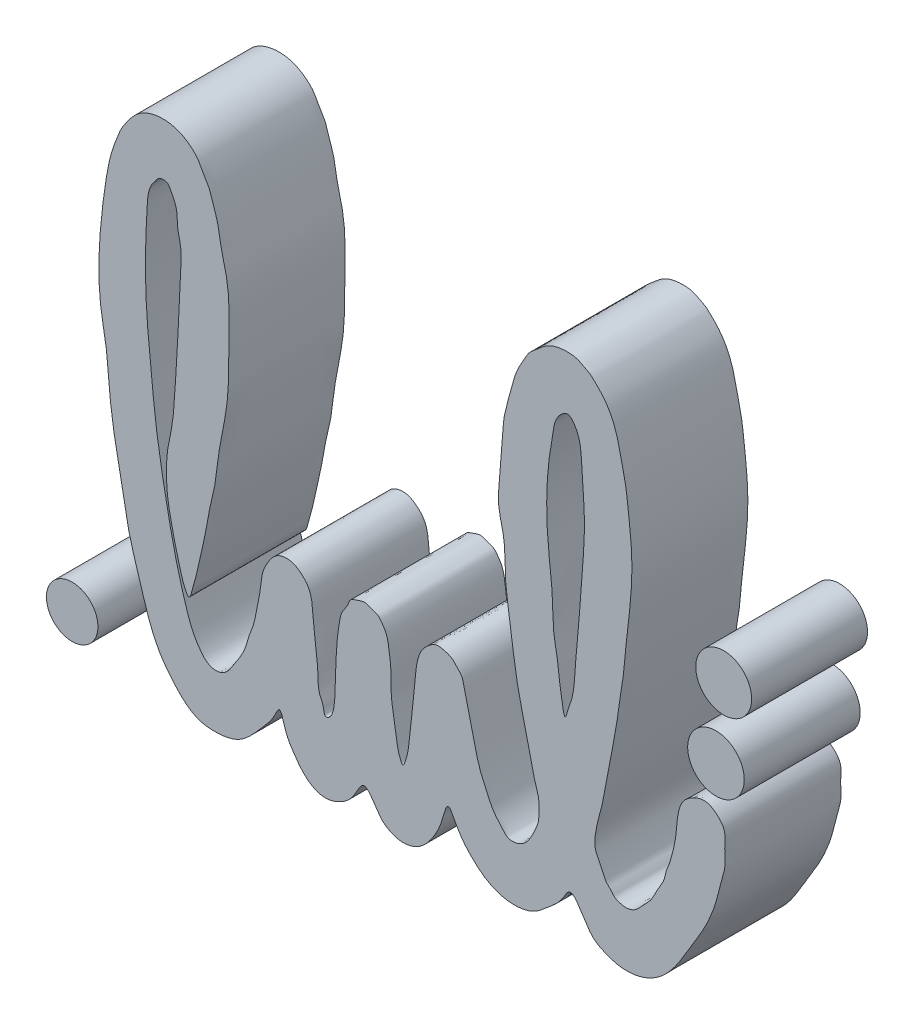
ISO-10303-21;
HEADER;
FILE_DESCRIPTION(('STEP AP214'),'2;1');
FILE_NAME('part.step','',(''),(''),'','','');
FILE_SCHEMA(('AUTOMOTIVE_DESIGN { 1 0 10303 214 1 1 1 1 }'));
ENDSEC;
DATA;
#1=APPLICATION_CONTEXT('core data for automotive mechanical design processes');
#2=APPLICATION_PROTOCOL_DEFINITION('international standard','automotive_design',2000,#1);
#3=PRODUCT_CONTEXT('',#1,'mechanical');
#4=PRODUCT('Part','Part','',(#3));
#5=PRODUCT_RELATED_PRODUCT_CATEGORY('part','',(#4));
#6=PRODUCT_DEFINITION_FORMATION('','',#4);
#7=PRODUCT_DEFINITION_CONTEXT('part definition',#1,'design');
#8=PRODUCT_DEFINITION('design','',#6,#7);
#9=PRODUCT_DEFINITION_SHAPE('','',#8);
#10=(LENGTH_UNIT() NAMED_UNIT(*) SI_UNIT(.MILLI.,.METRE.));
#11=(NAMED_UNIT(*) PLANE_ANGLE_UNIT() SI_UNIT($,.RADIAN.));
#12=(NAMED_UNIT(*) SI_UNIT($,.STERADIAN.) SOLID_ANGLE_UNIT());
#13=UNCERTAINTY_MEASURE_WITH_UNIT(LENGTH_MEASURE(1.E-05),#10,'distance_accuracy_value','');
#14=(GEOMETRIC_REPRESENTATION_CONTEXT(3) GLOBAL_UNCERTAINTY_ASSIGNED_CONTEXT((#13)) GLOBAL_UNIT_ASSIGNED_CONTEXT((#10,
#11,#12)) REPRESENTATION_CONTEXT('',''));
#15=CARTESIAN_POINT('',(0.,0.,0.));
#16=DIRECTION('',(0.,0.,1.));
#17=DIRECTION('',(1.,0.,0.));
#18=AXIS2_PLACEMENT_3D('',#15,#16,#17);
#19=CARTESIAN_POINT('',(10.0815790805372,1.43330764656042,3.6));
#20=DIRECTION('',(0.,0.,-1.));
#21=DIRECTION('',(-1.,0.,0.));
#22=AXIS2_PLACEMENT_3D('',#19,#20,#21);
#23=CYLINDRICAL_SURFACE('',#22,0.866436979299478);
#24=CARTESIAN_POINT('',(10.0815790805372,1.43330764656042,3.6));
#25=DIRECTION('',(0.,0.,1.));
#26=DIRECTION('',(1.,0.,0.));
#27=AXIS2_PLACEMENT_3D('',#24,#25,#26);
#28=CIRCLE('',#27,0.866436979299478);
#29=CARTESIAN_POINT('',(10.9480160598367,1.43330764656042,3.6));
#30=VERTEX_POINT('',#29);
#31=EDGE_CURVE('E11',#30,#30,#28,.T.);
#32=ORIENTED_EDGE('',*,*,#31,.F.);
#33=EDGE_LOOP('',(#32));
#34=FACE_BOUND('',#33,.T.);
#35=CARTESIAN_POINT('',(10.0815790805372,1.43330764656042,0.));
#36=DIRECTION('',(0.,0.,1.));
#37=DIRECTION('',(1.,0.,0.));
#38=AXIS2_PLACEMENT_3D('',#35,#36,#37);
#39=CIRCLE('',#38,0.866436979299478);
#40=CARTESIAN_POINT('',(10.9480160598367,1.43330764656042,0.));
#41=VERTEX_POINT('',#40);
#42=EDGE_CURVE('E42',#41,#41,#39,.T.);
#43=ORIENTED_EDGE('',*,*,#42,.T.);
#44=EDGE_LOOP('',(#43));
#45=FACE_BOUND('',#44,.T.);
#46=ADVANCED_FACE('F39',(#34,#45),#23,.T.);
#47=CARTESIAN_POINT('',(10.0815790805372,1.43330764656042,3.6));
#48=DIRECTION('',(0.,0.,1.));
#49=DIRECTION('',(1.,0.,0.));
#50=AXIS2_PLACEMENT_3D('',#47,#48,#49);
#51=PLANE('',#50);
#52=ORIENTED_EDGE('',*,*,#31,.T.);
#53=EDGE_LOOP('',(#52));
#54=FACE_BOUND('',#53,.T.);
#55=ADVANCED_FACE('F54',(#54),#51,.T.);
#56=CARTESIAN_POINT('',(10.0815790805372,1.43330764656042,0.));
#57=DIRECTION('',(0.,0.,1.));
#58=DIRECTION('',(1.,0.,0.));
#59=AXIS2_PLACEMENT_3D('',#56,#57,#58);
#60=PLANE('',#59);
#61=ORIENTED_EDGE('',*,*,#42,.F.);
#62=EDGE_LOOP('',(#61));
#63=FACE_BOUND('',#62,.T.);
#64=ADVANCED_FACE('F52',(#63),#60,.F.);
#65=CLOSED_SHELL('',(#46,#55,#64));
#66=MANIFOLD_SOLID_BREP('B2',#65);
#67=CARTESIAN_POINT('',(9.84206747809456,-0.855358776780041,3.6));
#68=DIRECTION('',(0.,0.,-1.));
#69=DIRECTION('',(-1.,0.,0.));
#70=AXIS2_PLACEMENT_3D('',#67,#68,#69);
#71=CYLINDRICAL_SURFACE('',#70,0.878209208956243);
#72=CARTESIAN_POINT('',(9.84206747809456,-0.855358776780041,3.6));
#73=DIRECTION('',(0.,0.,1.));
#74=DIRECTION('',(1.,0.,0.));
#75=AXIS2_PLACEMENT_3D('',#72,#73,#74);
#76=CIRCLE('',#75,0.878209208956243);
#77=CARTESIAN_POINT('',(10.7202766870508,-0.855358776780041,3.6));
#78=VERTEX_POINT('',#77);
#79=EDGE_CURVE('E38',#78,#78,#76,.T.);
#80=ORIENTED_EDGE('',*,*,#79,.F.);
#81=EDGE_LOOP('',(#80));
#82=FACE_BOUND('',#81,.T.);
#83=CARTESIAN_POINT('',(9.84206747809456,-0.855358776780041,0.));
#84=DIRECTION('',(0.,0.,1.));
#85=DIRECTION('',(1.,0.,0.));
#86=AXIS2_PLACEMENT_3D('',#83,#84,#85);
#87=CIRCLE('',#86,0.878209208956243);
#88=CARTESIAN_POINT('',(10.7202766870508,-0.855358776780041,0.));
#89=VERTEX_POINT('',#88);
#90=EDGE_CURVE('E90',#89,#89,#87,.T.);
#91=ORIENTED_EDGE('',*,*,#90,.T.);
#92=EDGE_LOOP('',(#91));
#93=FACE_BOUND('',#92,.T.);
#94=ADVANCED_FACE('F87',(#82,#93),#71,.T.);
#95=CARTESIAN_POINT('',(9.84206747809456,-0.855358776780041,3.6));
#96=DIRECTION('',(0.,0.,1.));
#97=DIRECTION('',(1.,0.,0.));
#98=AXIS2_PLACEMENT_3D('',#95,#96,#97);
#99=PLANE('',#98);
#100=ORIENTED_EDGE('',*,*,#79,.T.);
#101=EDGE_LOOP('',(#100));
#102=FACE_BOUND('',#101,.T.);
#103=ADVANCED_FACE('F102',(#102),#99,.T.);
#104=CARTESIAN_POINT('',(9.84206747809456,-0.855358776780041,0.));
#105=DIRECTION('',(0.,0.,1.));
#106=DIRECTION('',(1.,0.,0.));
#107=AXIS2_PLACEMENT_3D('',#104,#105,#106);
#108=PLANE('',#107);
#109=ORIENTED_EDGE('',*,*,#90,.F.);
#110=EDGE_LOOP('',(#109));
#111=FACE_BOUND('',#110,.T.);
#112=ADVANCED_FACE('F100',(#111),#108,.F.);
#113=CLOSED_SHELL('',(#94,#103,#112));
#114=MANIFOLD_SOLID_BREP('B6',#113);
#115=CARTESIAN_POINT('',(-10.1483436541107,-6.7735083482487,3.6));
#116=DIRECTION('',(0.,0.,-1.));
#117=DIRECTION('',(-1.,0.,0.));
#118=AXIS2_PLACEMENT_3D('',#115,#116,#117);
#119=CYLINDRICAL_SURFACE('',#118,0.799672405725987);
#120=CARTESIAN_POINT('',(-10.1483436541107,-6.7735083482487,3.6));
#121=DIRECTION('',(0.,0.,1.));
#122=DIRECTION('',(1.,0.,0.));
#123=AXIS2_PLACEMENT_3D('',#120,#121,#122);
#124=CIRCLE('',#123,0.799672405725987);
#125=CARTESIAN_POINT('',(-9.34867124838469,-6.7735083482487,3.6));
#126=VERTEX_POINT('',#125);
#127=EDGE_CURVE('E86',#126,#126,#124,.T.);
#128=ORIENTED_EDGE('',*,*,#127,.F.);
#129=EDGE_LOOP('',(#128));
#130=FACE_BOUND('',#129,.T.);
#131=CARTESIAN_POINT('',(-10.1483436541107,-6.7735083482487,0.));
#132=DIRECTION('',(0.,0.,1.));
#133=DIRECTION('',(1.,0.,0.));
#134=AXIS2_PLACEMENT_3D('',#131,#132,#133);
#135=CIRCLE('',#134,0.799672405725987);
#136=CARTESIAN_POINT('',(-9.34867124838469,-6.7735083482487,0.));
#137=VERTEX_POINT('',#136);
#138=EDGE_CURVE('E137',#137,#137,#135,.T.);
#139=ORIENTED_EDGE('',*,*,#138,.T.);
#140=EDGE_LOOP('',(#139));
#141=FACE_BOUND('',#140,.T.);
#142=ADVANCED_FACE('F134',(#130,#141),#119,.T.);
#143=CARTESIAN_POINT('',(-10.1483436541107,-6.7735083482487,3.6));
#144=DIRECTION('',(0.,0.,1.));
#145=DIRECTION('',(1.,0.,0.));
#146=AXIS2_PLACEMENT_3D('',#143,#144,#145);
#147=PLANE('',#146);
#148=ORIENTED_EDGE('',*,*,#127,.T.);
#149=EDGE_LOOP('',(#148));
#150=FACE_BOUND('',#149,.T.);
#151=ADVANCED_FACE('F149',(#150),#147,.T.);
#152=CARTESIAN_POINT('',(-10.1483436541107,-6.7735083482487,0.));
#153=DIRECTION('',(0.,0.,1.));
#154=DIRECTION('',(1.,0.,0.));
#155=AXIS2_PLACEMENT_3D('',#152,#153,#154);
#156=PLANE('',#155);
#157=ORIENTED_EDGE('',*,*,#138,.F.);
#158=EDGE_LOOP('',(#157));
#159=FACE_BOUND('',#158,.T.);
#160=ADVANCED_FACE('F147',(#159),#156,.F.);
#161=CLOSED_SHELL('',(#142,#151,#160));
#162=MANIFOLD_SOLID_BREP('B33',#161);
#163=CARTESIAN_POINT('',(-7.84357930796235,2.61084673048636,3.6));
#164=DIRECTION('',(0.,0.,-1.));
#165=DIRECTION('',(-1.,0.,0.));
#166=AXIS2_PLACEMENT_3D('',#163,#164,#165);
#167=PLANE('',#166);
#168=CARTESIAN_POINT('',(9.15796613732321,-2.12305920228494,3.6));
#169=CARTESIAN_POINT('',(9.02510179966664,-2.1872144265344,3.6));
#170=CARTESIAN_POINT('',(8.79222780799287,-2.34918255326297,3.6));
#171=CARTESIAN_POINT('',(8.61623881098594,-2.88996750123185,3.6));
#172=CARTESIAN_POINT('',(8.62215522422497,-3.44216824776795,3.6));
#173=CARTESIAN_POINT('',(8.48974806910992,-3.93563104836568,3.6));
#174=CARTESIAN_POINT('',(8.41029318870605,-4.26715294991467,3.6));
#175=CARTESIAN_POINT('',(8.28483133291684,-4.50344427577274,3.6));
#176=CARTESIAN_POINT('',(8.24558091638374,-4.81508898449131,3.6));
#177=CARTESIAN_POINT('',(8.0196976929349,-5.13441673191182,3.6));
#178=CARTESIAN_POINT('',(7.86771152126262,-5.51152221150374,3.6));
#179=CARTESIAN_POINT('',(7.62256017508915,-5.75342682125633,3.6));
#180=CARTESIAN_POINT('',(7.48158854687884,-5.90877588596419,3.6));
#181=CARTESIAN_POINT('',(7.3564442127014,-6.03578294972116,3.6));
#182=CARTESIAN_POINT('',(7.20066678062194,-6.11562868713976,3.6));
#183=CARTESIAN_POINT('',(7.01307048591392,-6.14160886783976,3.6));
#184=CARTESIAN_POINT('',(6.83519033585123,-6.09477772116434,3.6));
#185=CARTESIAN_POINT('',(6.68722582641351,-6.03788662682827,3.6));
#186=CARTESIAN_POINT('',(6.61052689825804,-5.92063582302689,3.6));
#187=CARTESIAN_POINT('',(6.52059639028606,-5.8415627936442,3.6));
#188=CARTESIAN_POINT('',(6.4194672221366,-5.73544277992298,3.6));
#189=CARTESIAN_POINT('',(6.32696243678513,-5.52206572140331,3.6));
#190=CARTESIAN_POINT('',(6.19652563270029,-5.28138815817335,3.6));
#191=CARTESIAN_POINT('',(6.04887942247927,-4.94313643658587,3.6));
#192=CARTESIAN_POINT('',(6.1041471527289,-4.58695114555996,3.6));
#193=CARTESIAN_POINT('',(6.16988785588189,-4.22227215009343,3.6));
#194=CARTESIAN_POINT('',(6.28697980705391,-3.86468136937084,3.6));
#195=CARTESIAN_POINT('',(6.35564876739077,-3.46790228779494,3.6));
#196=CARTESIAN_POINT('',(6.43391023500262,-3.04582680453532,3.6));
#197=CARTESIAN_POINT('',(6.52160115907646,-2.62887019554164,3.6));
#198=CARTESIAN_POINT('',(6.6124439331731,-2.17744645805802,3.6));
#199=CARTESIAN_POINT('',(6.67792439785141,-1.6948809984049,3.6));
#200=CARTESIAN_POINT('',(6.79361000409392,-1.16932879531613,3.6));
#201=CARTESIAN_POINT('',(6.84601434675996,-0.599677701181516,3.6));
#202=CARTESIAN_POINT('',(6.97051518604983,0.00688747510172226,3.6));
#203=CARTESIAN_POINT('',(7.02396668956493,0.753118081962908,3.6));
#204=CARTESIAN_POINT('',(7.15840122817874,1.84126684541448,3.6));
#205=CARTESIAN_POINT('',(7.28976850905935,3.18850129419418,3.6));
#206=CARTESIAN_POINT('',(7.13607919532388,4.41329132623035,3.6));
#207=CARTESIAN_POINT('',(7.04585057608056,5.23134594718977,3.6));
#208=CARTESIAN_POINT('',(6.93651110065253,5.68898695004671,3.6));
#209=CARTESIAN_POINT('',(6.85485691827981,6.05995383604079,3.6));
#210=CARTESIAN_POINT('',(6.75741310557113,6.49344597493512,3.6));
#211=CARTESIAN_POINT('',(6.59161460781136,6.90450767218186,3.6));
#212=CARTESIAN_POINT('',(6.32087086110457,7.29386205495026,3.6));
#213=CARTESIAN_POINT('',(6.10915865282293,7.50296630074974,3.6));
#214=CARTESIAN_POINT('',(5.91799232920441,7.68178143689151,3.6));
#215=CARTESIAN_POINT('',(5.75853676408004,7.75079845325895,3.6));
#216=CARTESIAN_POINT('',(5.53101287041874,7.88883804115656,3.6));
#217=CARTESIAN_POINT('',(5.17788675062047,7.92359045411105,3.6));
#218=CARTESIAN_POINT('',(4.83822612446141,7.87200544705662,3.6));
#219=CARTESIAN_POINT('',(4.51212961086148,7.71858688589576,3.6));
#220=CARTESIAN_POINT('',(4.29887179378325,7.51385503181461,3.6));
#221=CARTESIAN_POINT('',(3.98776118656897,7.26961650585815,3.6));
#222=CARTESIAN_POINT('',(3.86717551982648,6.98016724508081,3.6));
#223=CARTESIAN_POINT('',(3.67064423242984,6.66111547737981,3.6));
#224=CARTESIAN_POINT('',(3.53454703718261,6.26502698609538,3.6));
#225=CARTESIAN_POINT('',(3.40022155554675,5.72314191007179,3.6));
#226=CARTESIAN_POINT('',(3.24800594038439,5.19065902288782,3.6));
#227=CARTESIAN_POINT('',(3.21703461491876,4.65716234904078,3.6));
#228=CARTESIAN_POINT('',(3.16725975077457,4.14870972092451,3.6));
#229=CARTESIAN_POINT('',(3.13103409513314,3.47935379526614,3.6));
#230=CARTESIAN_POINT('',(3.03199582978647,2.72982482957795,3.6));
#231=CARTESIAN_POINT('',(3.32177926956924,1.83672671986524,3.6));
#232=CARTESIAN_POINT('',(3.26998048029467,0.953934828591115,3.6));
#233=CARTESIAN_POINT('',(3.38745462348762,0.150361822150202,3.6));
#234=CARTESIAN_POINT('',(3.48028931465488,-0.501578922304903,3.6));
#235=CARTESIAN_POINT('',(3.57449969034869,-1.20292245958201,3.6));
#236=CARTESIAN_POINT('',(3.70202946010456,-1.98915243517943,3.6));
#237=CARTESIAN_POINT('',(3.90540972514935,-2.79353436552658,3.6));
#238=CARTESIAN_POINT('',(4.08393187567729,-3.53523899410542,3.6));
#239=CARTESIAN_POINT('',(4.1933455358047,-4.10356769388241,3.6));
#240=CARTESIAN_POINT('',(4.35726888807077,-4.54636252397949,3.6));
#241=CARTESIAN_POINT('',(4.33982650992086,-4.86102597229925,3.6));
#242=CARTESIAN_POINT('',(4.34699334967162,-5.17309005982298,3.6));
#243=CARTESIAN_POINT('',(4.22693018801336,-5.45555217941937,3.6));
#244=CARTESIAN_POINT('',(4.08787131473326,-5.75789734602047,3.6));
#245=CARTESIAN_POINT('',(3.87014590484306,-6.02411966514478,3.6));
#246=CARTESIAN_POINT('',(3.60911902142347,-6.11490435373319,3.6));
#247=CARTESIAN_POINT('',(3.36248960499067,-6.10807382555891,3.6));
#248=CARTESIAN_POINT('',(3.21183944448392,-5.91896576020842,3.6));
#249=CARTESIAN_POINT('',(3.03772755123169,-5.73728441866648,3.6));
#250=CARTESIAN_POINT('',(2.86073635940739,-5.48713796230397,3.6));
#251=CARTESIAN_POINT('',(2.71370967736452,-5.14140958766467,3.6));
#252=CARTESIAN_POINT('',(2.50479410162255,-4.70921150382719,3.6));
#253=CARTESIAN_POINT('',(2.35354256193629,-4.13239512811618,3.6));
#254=CARTESIAN_POINT('',(2.20341265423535,-3.46651252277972,3.6));
#255=CARTESIAN_POINT('',(2.07361000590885,-2.91195959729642,3.6));
#256=CARTESIAN_POINT('',(1.99175355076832,-2.48128630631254,3.6));
#257=CARTESIAN_POINT('',(1.80388025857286,-2.29107202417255,3.6));
#258=CARTESIAN_POINT('',(1.64113766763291,-2.10498906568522,3.6));
#259=CARTESIAN_POINT('',(1.40508124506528,-2.03268987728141,3.6));
#260=CARTESIAN_POINT('',(1.15440142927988,-1.97541083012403,3.6));
#261=CARTESIAN_POINT('',(0.910601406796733,-2.1439384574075,3.6));
#262=CARTESIAN_POINT('',(0.708818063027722,-2.34311080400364,3.6));
#263=CARTESIAN_POINT('',(0.568143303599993,-2.67845113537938,3.6));
#264=CARTESIAN_POINT('',(0.495691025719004,-3.21818597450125,3.6));
#265=CARTESIAN_POINT('',(0.44511361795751,-3.89651307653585,3.6));
#266=CARTESIAN_POINT('',(0.354226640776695,-4.63207920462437,3.6));
#267=CARTESIAN_POINT('',(0.305430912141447,-5.2131521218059,3.6));
#268=CARTESIAN_POINT('',(0.22923825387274,-5.52872149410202,3.6));
#269=CARTESIAN_POINT('',(0.120846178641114,-5.84477562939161,3.6));
#270=CARTESIAN_POINT('',(-0.0317597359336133,-5.46924497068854,3.6));
#271=CARTESIAN_POINT('',(-0.0729104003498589,-5.16957587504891,3.6));
#272=CARTESIAN_POINT('',(-0.15506219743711,-4.60042320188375,3.6));
#273=CARTESIAN_POINT('',(-0.26451691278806,-4.07791753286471,3.6));
#274=CARTESIAN_POINT('',(-0.22532221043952,-3.47832966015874,3.6));
#275=CARTESIAN_POINT('',(-0.296852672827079,-2.97820266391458,3.6));
#276=CARTESIAN_POINT('',(-0.359836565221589,-2.50437826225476,3.6));
#277=CARTESIAN_POINT('',(-0.525460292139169,-2.26281118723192,3.6));
#278=CARTESIAN_POINT('',(-0.663475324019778,-2.09502469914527,3.6));
#279=CARTESIAN_POINT('',(-0.850742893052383,-2.05536641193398,3.6));
#280=CARTESIAN_POINT('',(-1.07451048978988,-1.9331921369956,3.6));
#281=CARTESIAN_POINT('',(-1.29462651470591,-2.04696584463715,3.6));
#282=CARTESIAN_POINT('',(-1.53280657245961,-2.10485357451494,3.6));
#283=CARTESIAN_POINT('',(-1.5881303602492,-2.35772833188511,3.6));
#284=CARTESIAN_POINT('',(-1.78712460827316,-2.563162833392,3.6));
#285=CARTESIAN_POINT('',(-1.86776422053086,-2.98170829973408,3.6));
#286=CARTESIAN_POINT('',(-1.97743516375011,-3.80027854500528,3.6));
#287=CARTESIAN_POINT('',(-1.95675978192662,-4.66709517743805,3.6));
#288=CARTESIAN_POINT('',(-2.02529862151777,-5.3994610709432,3.6));
#289=CARTESIAN_POINT('',(-2.13841019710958,-5.61323965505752,3.6));
#290=CARTESIAN_POINT('',(-2.32798941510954,-5.69313910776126,3.6));
#291=CARTESIAN_POINT('',(-2.33471701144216,-5.38173885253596,3.6));
#292=CARTESIAN_POINT('',(-2.53691551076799,-5.07390439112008,3.6));
#293=CARTESIAN_POINT('',(-2.49696841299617,-4.51744445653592,3.6));
#294=CARTESIAN_POINT('',(-2.61375636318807,-3.81945100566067,3.6));
#295=CARTESIAN_POINT('',(-2.664988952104,-3.16480241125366,3.6));
#296=CARTESIAN_POINT('',(-2.7157006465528,-2.61782607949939,3.6));
#297=CARTESIAN_POINT('',(-2.8687491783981,-2.34743329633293,3.6));
#298=CARTESIAN_POINT('',(-3.03573036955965,-2.18249910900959,3.6));
#299=CARTESIAN_POINT('',(-3.29406199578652,-1.99084478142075,3.6));
#300=CARTESIAN_POINT('',(-3.68151153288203,-1.98852146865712,3.6));
#301=CARTESIAN_POINT('',(-3.96398482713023,-2.21165350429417,3.6));
#302=CARTESIAN_POINT('',(-4.08977133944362,-2.44074409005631,3.6));
#303=CARTESIAN_POINT('',(-4.25463297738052,-2.73553061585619,3.6));
#304=CARTESIAN_POINT('',(-4.28047820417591,-3.12923956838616,3.6));
#305=CARTESIAN_POINT('',(-4.36368754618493,-3.58239479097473,3.6));
#306=CARTESIAN_POINT('',(-4.44422988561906,-3.97665571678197,3.6));
#307=CARTESIAN_POINT('',(-4.50871914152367,-4.31688205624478,3.6));
#308=CARTESIAN_POINT('',(-4.6347406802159,-4.57895059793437,3.6));
#309=CARTESIAN_POINT('',(-4.69967491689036,-4.83926211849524,3.6));
#310=CARTESIAN_POINT('',(-4.79566038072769,-5.12472113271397,3.6));
#311=CARTESIAN_POINT('',(-4.9375859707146,-5.40796964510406,3.6));
#312=CARTESIAN_POINT('',(-5.13537650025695,-5.66712987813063,3.6));
#313=CARTESIAN_POINT('',(-5.27678285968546,-5.94273713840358,3.6));
#314=CARTESIAN_POINT('',(-5.52947046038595,-6.12816018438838,3.6));
#315=CARTESIAN_POINT('',(-5.84208793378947,-6.12373370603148,3.6));
#316=CARTESIAN_POINT('',(-6.04164767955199,-5.98042458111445,3.6));
#317=CARTESIAN_POINT('',(-6.22851489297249,-5.73842179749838,3.6));
#318=CARTESIAN_POINT('',(-6.42144962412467,-5.4305057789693,3.6));
#319=CARTESIAN_POINT('',(-6.5929691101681,-4.93712736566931,3.6));
#320=CARTESIAN_POINT('',(-6.71807787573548,-4.51740242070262,3.6));
#321=CARTESIAN_POINT('',(-6.89947657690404,-3.8798923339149,3.6));
#322=CARTESIAN_POINT('',(-7.06562617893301,-3.15117212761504,3.6));
#323=CARTESIAN_POINT('',(-7.3338656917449,-1.81182097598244,3.6));
#324=CARTESIAN_POINT('',(-7.5432586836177,-0.587142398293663,3.6));
#325=CARTESIAN_POINT('',(-7.7176077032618,1.12552490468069,3.6));
#326=CARTESIAN_POINT('',(-7.91163483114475,2.93590512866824,3.6));
#327=CARTESIAN_POINT('',(-7.86577212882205,4.64118310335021,3.6));
#328=CARTESIAN_POINT('',(-7.79929108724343,5.66963607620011,3.6));
#329=CARTESIAN_POINT('',(-7.69432271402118,5.94356706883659,3.6));
#330=CARTESIAN_POINT('',(-7.56561572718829,6.1020195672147,3.6));
#331=CARTESIAN_POINT('',(-7.45474461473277,6.27497467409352,3.6));
#332=CARTESIAN_POINT('',(-7.16955574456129,6.28022773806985,3.6));
#333=CARTESIAN_POINT('',(-7.05442535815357,6.01339878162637,3.6));
#334=CARTESIAN_POINT('',(-6.85645134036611,5.66542953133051,3.6));
#335=CARTESIAN_POINT('',(-6.90490825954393,5.22616444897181,3.6));
#336=CARTESIAN_POINT('',(-6.72500762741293,4.61307083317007,3.6));
#337=CARTESIAN_POINT('',(-6.81056941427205,3.7937116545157,3.6));
#338=CARTESIAN_POINT('',(-6.8406931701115,2.63037788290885,3.6));
#339=CARTESIAN_POINT('',(-6.9139805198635,1.51050926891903,3.6));
#340=CARTESIAN_POINT('',(-6.9680727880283,0.501856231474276,3.6));
#341=CARTESIAN_POINT('',(-7.03398758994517,-0.237668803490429,3.6));
#342=CARTESIAN_POINT('',(-7.2189313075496,-0.970858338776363,3.6));
#343=CARTESIAN_POINT('',(-7.23370492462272,-1.68569486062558,3.6));
#344=CARTESIAN_POINT('',(-7.18059632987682,-2.34309788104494,3.6));
#345=CARTESIAN_POINT('',(-7.06370491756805,-2.82563339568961,3.6));
#346=CARTESIAN_POINT('',(-6.99185103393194,-3.19954310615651,3.6));
#347=CARTESIAN_POINT('',(-6.90013641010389,-3.55740754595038,3.6));
#348=CARTESIAN_POINT('',(-6.80919314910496,-3.88450619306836,3.6));
#349=CARTESIAN_POINT('',(-6.73265362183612,-4.18468087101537,3.6));
#350=CARTESIAN_POINT('',(-6.51013634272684,-4.7651728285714,3.6));
#351=CARTESIAN_POINT('',(-6.401842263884,-4.19291991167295,3.6));
#352=CARTESIAN_POINT('',(-6.29759447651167,-3.90912253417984,3.6));
#353=CARTESIAN_POINT('',(-6.20536528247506,-3.39841287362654,3.6));
#354=CARTESIAN_POINT('',(-6.02825713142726,-2.7780199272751,3.6));
#355=CARTESIAN_POINT('',(-5.9180311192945,-1.94042302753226,3.6));
#356=CARTESIAN_POINT('',(-5.70336446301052,-1.20459128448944,3.6));
#357=CARTESIAN_POINT('',(-5.63474375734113,-0.376273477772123,3.6));
#358=CARTESIAN_POINT('',(-5.47793466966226,0.413095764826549,3.6));
#359=CARTESIAN_POINT('',(-5.294931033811,1.38803732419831,3.6));
#360=CARTESIAN_POINT('',(-5.2912080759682,2.40957564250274,3.6));
#361=CARTESIAN_POINT('',(-5.26336883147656,3.54497859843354,3.6));
#362=CARTESIAN_POINT('',(-5.29493102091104,4.50825156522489,3.6));
#363=CARTESIAN_POINT('',(-5.54369437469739,5.32309788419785,3.6));
#364=CARTESIAN_POINT('',(-5.59747601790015,5.94422478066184,3.6));
#365=CARTESIAN_POINT('',(-5.79919038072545,6.42241213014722,3.6));
#366=CARTESIAN_POINT('',(-5.87391588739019,6.72945850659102,3.6));
#367=CARTESIAN_POINT('',(-6.05100854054,6.9790184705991,3.6));
#368=CARTESIAN_POINT('',(-6.17977187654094,7.30041869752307,3.6));
#369=CARTESIAN_POINT('',(-6.50002968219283,7.63444397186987,3.6));
#370=CARTESIAN_POINT('',(-6.99753082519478,7.91579963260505,3.6));
#371=CARTESIAN_POINT('',(-7.60443928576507,7.91202656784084,3.6));
#372=CARTESIAN_POINT('',(-8.09563555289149,7.68000699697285,3.6));
#373=CARTESIAN_POINT('',(-8.38108519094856,7.36103174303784,3.6));
#374=CARTESIAN_POINT('',(-8.62402927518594,7.01225118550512,3.6));
#375=CARTESIAN_POINT('',(-8.78992955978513,6.59170717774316,3.6));
#376=CARTESIAN_POINT('',(-8.9373883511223,6.19194865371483,3.6));
#377=CARTESIAN_POINT('',(-9.08311784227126,5.5291198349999,3.6));
#378=CARTESIAN_POINT('',(-9.28998746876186,4.04999404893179,3.6));
#379=CARTESIAN_POINT('',(-9.40491242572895,2.37866032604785,3.6));
#380=CARTESIAN_POINT('',(-9.0759677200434,0.893755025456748,3.6));
#381=CARTESIAN_POINT('',(-9.01113854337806,-0.133539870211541,3.6));
#382=CARTESIAN_POINT('',(-8.87092145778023,-1.33924289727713,3.6));
#383=CARTESIAN_POINT('',(-8.57532101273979,-2.63348262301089,3.6));
#384=CARTESIAN_POINT('',(-8.40626740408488,-3.78108658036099,3.6));
#385=CARTESIAN_POINT('',(-7.98534669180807,-5.03110284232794,3.6));
#386=CARTESIAN_POINT('',(-7.67965121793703,-6.23484940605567,3.6));
#387=CARTESIAN_POINT('',(-6.94755296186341,-7.19052679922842,3.6));
#388=CARTESIAN_POINT('',(-6.36871759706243,-7.73700939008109,3.6));
#389=CARTESIAN_POINT('',(-5.63915709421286,-7.79810165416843,3.6));
#390=CARTESIAN_POINT('',(-5.01995828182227,-7.7126794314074,3.6));
#391=CARTESIAN_POINT('',(-4.54801892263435,-7.2926784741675,3.6));
#392=CARTESIAN_POINT('',(-4.18237019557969,-6.85002194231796,3.6));
#393=CARTESIAN_POINT('',(-3.91514143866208,-6.56681697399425,3.6));
#394=CARTESIAN_POINT('',(-3.68945494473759,-6.00176955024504,3.6));
#395=CARTESIAN_POINT('',(-3.52421500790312,-6.75220663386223,3.6));
#396=CARTESIAN_POINT('',(-3.27074247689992,-7.12457975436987,3.6));
#397=CARTESIAN_POINT('',(-2.90211973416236,-7.65483982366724,3.6));
#398=CARTESIAN_POINT('',(-2.32714179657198,-7.92359045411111,3.6));
#399=CARTESIAN_POINT('',(-1.7511724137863,-7.7135289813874,3.6));
#400=CARTESIAN_POINT('',(-1.3865224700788,-7.40142948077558,3.6));
#401=CARTESIAN_POINT('',(-1.09938284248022,-6.69007422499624,3.6));
#402=CARTESIAN_POINT('',(-0.733888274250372,-7.30363331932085,3.6));
#403=CARTESIAN_POINT('',(-0.453672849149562,-7.68515060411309,3.6));
#404=CARTESIAN_POINT('',(0.0785273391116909,-7.91376117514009,3.6));
#405=CARTESIAN_POINT('',(0.635287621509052,-7.74006600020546,3.6));
#406=CARTESIAN_POINT('',(0.977790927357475,-7.37464984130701,3.6));
#407=CARTESIAN_POINT('',(1.23338587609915,-6.94332783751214,3.6));
#408=CARTESIAN_POINT('',(1.3533865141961,-6.59631144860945,3.6));
#409=CARTESIAN_POINT('',(1.51204429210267,-6.00273117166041,3.6));
#410=CARTESIAN_POINT('',(1.83233899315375,-6.67643514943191,3.6));
#411=CARTESIAN_POINT('',(2.13134633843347,-7.06704143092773,3.6));
#412=CARTESIAN_POINT('',(2.74897297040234,-7.62937526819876,3.6));
#413=CARTESIAN_POINT('',(3.49355841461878,-7.85986772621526,3.6));
#414=CARTESIAN_POINT('',(4.18968173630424,-7.71389616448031,3.6));
#415=CARTESIAN_POINT('',(4.66095153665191,-7.29162250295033,3.6));
#416=CARTESIAN_POINT('',(5.0195747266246,-7.01590647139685,3.6));
#417=CARTESIAN_POINT('',(5.39547014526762,-6.25729336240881,3.6));
#418=CARTESIAN_POINT('',(5.79278274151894,-7.32957086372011,3.6));
#419=CARTESIAN_POINT('',(6.2446873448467,-7.60614108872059,3.6));
#420=CARTESIAN_POINT('',(6.51717306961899,-7.71629222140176,3.6));
#421=CARTESIAN_POINT('',(6.98950187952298,-7.86533912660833,3.6));
#422=CARTESIAN_POINT('',(7.72859507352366,-7.77393033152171,3.6));
#423=CARTESIAN_POINT('',(8.47707936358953,-7.16957311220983,3.6));
#424=CARTESIAN_POINT('',(8.96107925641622,-6.32022784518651,3.6));
#425=CARTESIAN_POINT('',(9.50048779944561,-5.48452456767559,3.6));
#426=CARTESIAN_POINT('',(9.84095123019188,-4.66897155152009,3.6));
#427=CARTESIAN_POINT('',(9.97699957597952,-4.00647493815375,3.6));
#428=CARTESIAN_POINT('',(10.152836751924,-3.50625809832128,3.6));
#429=CARTESIAN_POINT('',(10.0845254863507,-3.01523541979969,3.6));
#430=CARTESIAN_POINT('',(10.1777960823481,-2.52767315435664,3.6));
#431=CARTESIAN_POINT('',(9.86860816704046,-2.19600584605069,3.6));
#432=CARTESIAN_POINT('',(9.5400077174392,-1.98028213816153,3.6));
#433=CARTESIAN_POINT('',(9.27825593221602,-2.06497575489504,3.6));
#434=CARTESIAN_POINT('',(9.15796613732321,-2.12305920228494,3.6));
#435=B_SPLINE_CURVE_WITH_KNOTS('',3,(#168,#169,#170,#171,#172,#173,#174,#175,#176,#177,#178,
#179,#180,#181,#182,#183,#184,#185,#186,#187,#188,#189,#190,#191,#192,#193,#194,#195,#196,#197,
#198,#199,#200,#201,#202,#203,#204,#205,#206,#207,#208,#209,#210,#211,#212,#213,#214,#215,#216,
#217,#218,#219,#220,#221,#222,#223,#224,#225,#226,#227,#228,#229,#230,#231,#232,#233,#234,#235,
#236,#237,#238,#239,#240,#241,#242,#243,#244,#245,#246,#247,#248,#249,#250,#251,#252,#253,#254,
#255,#256,#257,#258,#259,#260,#261,#262,#263,#264,#265,#266,#267,#268,#269,#270,#271,#272,#273,
#274,#275,#276,#277,#278,#279,#280,#281,#282,#283,#284,#285,#286,#287,#288,#289,#290,#291,#292,
#293,#294,#295,#296,#297,#298,#299,#300,#301,#302,#303,#304,#305,#306,#307,#308,#309,#310,#311,
#312,#313,#314,#315,#316,#317,#318,#319,#320,#321,#322,#323,#324,#325,#326,#327,#328,#329,#330,
#331,#332,#333,#334,#335,#336,#337,#338,#339,#340,#341,#342,#343,#344,#345,#346,#347,#348,#349,
#350,#351,#352,#353,#354,#355,#356,#357,#358,#359,#360,#361,#362,#363,#364,#365,#366,#367,#368,
#369,#370,#371,#372,#373,#374,#375,#376,#377,#378,#379,#380,#381,#382,#383,#384,#385,#386,#387,
#388,#389,#390,#391,#392,#393,#394,#395,#396,#397,#398,#399,#400,#401,#402,#403,#404,#405,#406,
#407,#408,#409,#410,#411,#412,#413,#414,#415,#416,#417,#418,#419,#420,#421,#422,#423,#424,#425,
#426,#427,#428,#429,#430,#431,#432,#433,#434),.UNSPECIFIED.,.T.,.F.,(4,1,1,1,1,1,1,1,1,1,1,1,1,
1,1,1,1,1,1,1,1,1,1,1,1,1,1,1,1,1,1,1,1,1,1,1,1,1,1,1,1,1,1,1,1,1,1,1,1,1,1,1,1,1,1,1,1,1,1,1,1,
1,1,1,1,1,1,1,1,1,1,1,1,1,1,1,1,1,1,1,1,1,1,1,1,1,1,1,1,1,1,1,1,1,1,1,1,1,1,1,1,1,1,1,1,1,1,1,1,
1,1,1,1,1,1,1,1,1,1,1,1,1,1,1,1,1,1,1,1,1,1,1,1,1,1,1,1,1,1,1,1,1,1,1,1,1,1,1,1,1,1,1,1,1,1,1,1,
1,1,1,1,1,1,1,1,1,1,1,1,1,1,1,1,1,1,1,1,1,1,1,1,1,1,1,1,1,1,1,1,1,1,1,1,1,1,1,1,1,1,1,1,1,1,1,1,
1,1,1,1,1,1,1,1,1,1,1,1,1,1,1,1,1,1,1,1,1,1,1,1,1,1,1,1,1,1,1,1,1,1,1,1,1,1,1,1,1,1,1,1,1,1,1,1,
1,1,1,1,1,1,1,1,1,1,1,4),(0.,0.00296589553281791,0.00576754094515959,0.0114461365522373,
0.0145592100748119,0.0164529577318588,0.0185945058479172,0.0201088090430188,0.0229398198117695,
0.026628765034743,0.0285386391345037,0.0301011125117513,0.0310551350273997,0.0322613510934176,
0.0337146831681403,0.0349048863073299,0.0361317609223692,0.0368908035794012,0.037778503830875,
0.0386511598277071,0.0399407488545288,0.0426041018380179,0.0444645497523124,0.0475358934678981,
0.0498872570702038,0.0523092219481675,0.0554052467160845,0.0583394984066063,0.0613312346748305,
0.0643581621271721,0.0680127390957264,0.0715589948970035,0.0756514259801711,0.0800138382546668,
0.0845490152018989,0.0913476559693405,0.103081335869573,0.112823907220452,0.117203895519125,
0.120360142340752,0.122699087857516,0.125187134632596,0.129697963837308,0.131892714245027,
0.135106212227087,0.135945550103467,0.137358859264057,0.138715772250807,0.141505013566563,
0.144553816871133,0.145855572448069,0.149008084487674,0.150717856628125,0.154078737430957,
0.155376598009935,0.158604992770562,0.162787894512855,0.167150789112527,0.170173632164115,
0.173986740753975,0.177883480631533,0.18429935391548,0.189583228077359,0.197257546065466,
0.202651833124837,0.206628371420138,0.211097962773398,0.217522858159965,0.223348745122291,
0.228525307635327,0.23354865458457,0.235517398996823,0.238339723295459,0.240079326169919,
0.242013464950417,0.244666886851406,0.24714688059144,0.2489165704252,0.250359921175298,
0.251959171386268,0.253679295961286,0.25574114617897,0.258319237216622,0.261565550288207,
0.265805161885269,0.270805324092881,0.275874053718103,0.27793099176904,0.279734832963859,
0.281379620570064,0.283010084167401,0.284853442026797,0.28645862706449,0.288904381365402,
0.290789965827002,0.293952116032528,0.300320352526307,0.305005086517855,0.30980618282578,
0.311761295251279,0.31310735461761,0.314356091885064,0.317519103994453,0.320976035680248,
0.325851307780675,0.328859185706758,0.333471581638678,0.336532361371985,0.338662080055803,
0.339577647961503,0.340968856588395,0.342559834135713,0.344609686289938,0.345831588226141,
0.347357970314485,0.349441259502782,0.351762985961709,0.356022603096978,0.366953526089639,
0.369891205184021,0.371358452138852,0.371838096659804,0.373656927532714,0.375422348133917,
0.380368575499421,0.384246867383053,0.390538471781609,0.394174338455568,0.395562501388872,
0.396961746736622,0.399090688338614,0.402198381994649,0.404217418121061,0.406369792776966,
0.407658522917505,0.411272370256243,0.414429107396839,0.417389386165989,0.419730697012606,
0.421664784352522,0.423457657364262,0.425355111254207,0.427988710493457,0.43006672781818,
0.432188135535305,0.434468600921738,0.43620702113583,0.438405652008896,0.439344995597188,
0.442647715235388,0.445969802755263,0.450281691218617,0.451859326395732,0.459895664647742,
0.465975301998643,0.480567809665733,0.485969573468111,0.502153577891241,0.518756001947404,
0.521787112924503,0.523742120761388,0.524764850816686,0.526095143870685,0.527899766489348,
0.52935974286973,0.531749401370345,0.5363662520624,0.538062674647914,0.545131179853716,
0.553260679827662,0.562674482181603,0.568657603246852,0.574507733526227,0.578230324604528,
0.584498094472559,0.58941623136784,0.59204594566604,0.594925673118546,0.597389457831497,
0.599895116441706,0.601759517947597,0.604935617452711,0.607247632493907,0.609806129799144,
0.612347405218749,0.617761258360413,0.623534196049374,0.62999357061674,0.633807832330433,
0.640952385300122,0.646902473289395,0.654607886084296,0.662331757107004,0.67085031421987,
0.674625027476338,0.680185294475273,0.683784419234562,0.685501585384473,0.686739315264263,
0.690158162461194,0.692685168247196,0.696311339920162,0.701912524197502,0.704601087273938,
0.707520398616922,0.710774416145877,0.713496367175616,0.7169807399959,0.719722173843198,
0.727727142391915,0.748428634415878,0.754284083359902,0.759583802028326,0.770031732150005,
0.779746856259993,0.787481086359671,0.794308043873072,0.807525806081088,0.812868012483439,
0.8197100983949,0.823147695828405,0.827946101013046,0.832342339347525,0.836100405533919,
0.83966233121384,0.841751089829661,0.845021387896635,0.849113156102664,0.85345133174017,
0.85784674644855,0.861365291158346,0.865414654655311,0.86879818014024,0.87269190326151,
0.875248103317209,0.879725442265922,0.883435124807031,0.886784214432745,0.890146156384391,
0.893465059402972,0.896071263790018,0.89839728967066,0.904146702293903,0.908858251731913,
0.915033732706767,0.919962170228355,0.922981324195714,0.928065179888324,0.930052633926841,
0.937835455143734,0.940079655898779,0.941906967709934,0.9439085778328,0.950504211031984,
0.956401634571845,0.963502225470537,0.970901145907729,0.977332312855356,0.981871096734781,
0.985180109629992,0.98821377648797,0.992286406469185,0.994636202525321,0.99731480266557,1.),.UNSPECIFIED.);
#436=CARTESIAN_POINT('',(9.15796613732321,-2.12305920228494,3.6));
#437=VERTEX_POINT('',#436);
#438=EDGE_CURVE('E133',#437,#437,#435,.T.);
#439=ORIENTED_EDGE('',*,*,#438,.T.);
#440=EDGE_LOOP('',(#439));
#441=FACE_BOUND('',#440,.T.);
#442=CARTESIAN_POINT('',(5.25195258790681,-1.69096679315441,3.6));
#443=CARTESIAN_POINT('',(5.43395665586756,-1.22783572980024,3.6));
#444=CARTESIAN_POINT('',(5.43675140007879,-0.726258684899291,3.6));
#445=CARTESIAN_POINT('',(5.59238471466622,0.83008740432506,3.6));
#446=CARTESIAN_POINT('',(5.67404674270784,2.10481164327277,3.6));
#447=CARTESIAN_POINT('',(5.812099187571,3.56097959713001,3.6));
#448=CARTESIAN_POINT('',(5.66772918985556,4.93594189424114,3.6));
#449=CARTESIAN_POINT('',(5.64163503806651,5.84300877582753,3.6));
#450=CARTESIAN_POINT('',(5.24359504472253,6.32371585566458,3.6));
#451=CARTESIAN_POINT('',(4.81933262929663,5.95960087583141,3.6));
#452=CARTESIAN_POINT('',(4.78210557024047,5.44428719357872,3.6));
#453=CARTESIAN_POINT('',(4.64903074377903,4.75027446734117,3.6));
#454=CARTESIAN_POINT('',(4.56284889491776,3.7333693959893,3.6));
#455=CARTESIAN_POINT('',(4.60227434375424,2.45306490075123,3.6));
#456=CARTESIAN_POINT('',(4.78805876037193,1.17250509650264,3.6));
#457=CARTESIAN_POINT('',(4.77029241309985,0.176171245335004,3.6));
#458=CARTESIAN_POINT('',(4.92759240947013,-0.482030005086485,3.6));
#459=CARTESIAN_POINT('',(4.99003867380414,-1.17670780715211,3.6));
#460=CARTESIAN_POINT('',(5.01924666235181,-1.23167758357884,3.6));
#461=CARTESIAN_POINT('',(5.14369653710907,-2.1537083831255,3.6));
#462=CARTESIAN_POINT('',(5.22909013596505,-1.74884102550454,3.6));
#463=CARTESIAN_POINT('',(5.24989517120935,-1.69620213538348,3.6));
#464=CARTESIAN_POINT('',(5.25195258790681,-1.69096679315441,3.6));
#465=B_SPLINE_CURVE_WITH_KNOTS('',3,(#442,#443,#444,#445,#446,#447,#448,#449,#450,#451,#452,
#453,#454,#455,#456,#457,#458,#459,#460,#461,#462,#463,#464),.UNSPECIFIED.,.T.,.F.,(4,1,1,1,1,1,
1,1,1,1,1,1,1,1,1,1,1,1,1,1,4),(0.,0.0743789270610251,0.155616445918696,0.222267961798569,
0.322969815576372,0.415893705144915,0.47383398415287,0.490168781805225,0.510583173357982,
0.552191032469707,0.585467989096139,0.638853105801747,0.738105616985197,0.817476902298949,
0.876243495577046,0.914419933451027,0.949592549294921,0.976413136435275,0.991592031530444,
0.999159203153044,1.),.UNSPECIFIED.);
#466=CARTESIAN_POINT('',(5.25195258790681,-1.69096679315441,3.6));
#467=VERTEX_POINT('',#466);
#468=EDGE_CURVE('E187',#467,#467,#465,.T.);
#469=ORIENTED_EDGE('',*,*,#468,.F.);
#470=EDGE_LOOP('',(#469));
#471=FACE_BOUND('',#470,.T.);
#472=ADVANCED_FACE('F174',(#441,#471),#167,.F.);
#473=CARTESIAN_POINT('',(-7.84357930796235,2.61084673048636,0.));
#474=DIRECTION('',(0.,0.,-1.));
#475=DIRECTION('',(-1.,0.,0.));
#476=AXIS2_PLACEMENT_3D('',#473,#474,#475);
#477=PLANE('',#476);
#478=CARTESIAN_POINT('',(9.15796613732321,-2.12305920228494,0.));
#479=CARTESIAN_POINT('',(9.02510179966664,-2.1872144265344,0.));
#480=CARTESIAN_POINT('',(8.79222780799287,-2.34918255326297,0.));
#481=CARTESIAN_POINT('',(8.61623881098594,-2.88996750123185,0.));
#482=CARTESIAN_POINT('',(8.62215522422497,-3.44216824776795,0.));
#483=CARTESIAN_POINT('',(8.48974806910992,-3.93563104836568,0.));
#484=CARTESIAN_POINT('',(8.41029318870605,-4.26715294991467,0.));
#485=CARTESIAN_POINT('',(8.28483133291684,-4.50344427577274,0.));
#486=CARTESIAN_POINT('',(8.24558091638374,-4.81508898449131,0.));
#487=CARTESIAN_POINT('',(8.0196976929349,-5.13441673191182,0.));
#488=CARTESIAN_POINT('',(7.86771152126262,-5.51152221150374,0.));
#489=CARTESIAN_POINT('',(7.62256017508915,-5.75342682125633,0.));
#490=CARTESIAN_POINT('',(7.48158854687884,-5.90877588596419,0.));
#491=CARTESIAN_POINT('',(7.3564442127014,-6.03578294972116,0.));
#492=CARTESIAN_POINT('',(7.20066678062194,-6.11562868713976,0.));
#493=CARTESIAN_POINT('',(7.01307048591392,-6.14160886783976,0.));
#494=CARTESIAN_POINT('',(6.83519033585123,-6.09477772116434,0.));
#495=CARTESIAN_POINT('',(6.68722582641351,-6.03788662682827,0.));
#496=CARTESIAN_POINT('',(6.61052689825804,-5.92063582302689,0.));
#497=CARTESIAN_POINT('',(6.52059639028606,-5.8415627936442,0.));
#498=CARTESIAN_POINT('',(6.4194672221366,-5.73544277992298,0.));
#499=CARTESIAN_POINT('',(6.32696243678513,-5.52206572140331,0.));
#500=CARTESIAN_POINT('',(6.19652563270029,-5.28138815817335,0.));
#501=CARTESIAN_POINT('',(6.04887942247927,-4.94313643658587,0.));
#502=CARTESIAN_POINT('',(6.1041471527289,-4.58695114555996,0.));
#503=CARTESIAN_POINT('',(6.16988785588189,-4.22227215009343,0.));
#504=CARTESIAN_POINT('',(6.28697980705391,-3.86468136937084,0.));
#505=CARTESIAN_POINT('',(6.35564876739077,-3.46790228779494,0.));
#506=CARTESIAN_POINT('',(6.43391023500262,-3.04582680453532,0.));
#507=CARTESIAN_POINT('',(6.52160115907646,-2.62887019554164,0.));
#508=CARTESIAN_POINT('',(6.6124439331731,-2.17744645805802,0.));
#509=CARTESIAN_POINT('',(6.67792439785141,-1.6948809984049,0.));
#510=CARTESIAN_POINT('',(6.79361000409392,-1.16932879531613,0.));
#511=CARTESIAN_POINT('',(6.84601434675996,-0.599677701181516,0.));
#512=CARTESIAN_POINT('',(6.97051518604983,0.00688747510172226,0.));
#513=CARTESIAN_POINT('',(7.02396668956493,0.753118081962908,0.));
#514=CARTESIAN_POINT('',(7.15840122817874,1.84126684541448,0.));
#515=CARTESIAN_POINT('',(7.28976850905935,3.18850129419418,0.));
#516=CARTESIAN_POINT('',(7.13607919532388,4.41329132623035,0.));
#517=CARTESIAN_POINT('',(7.04585057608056,5.23134594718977,0.));
#518=CARTESIAN_POINT('',(6.93651110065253,5.68898695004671,0.));
#519=CARTESIAN_POINT('',(6.85485691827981,6.05995383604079,0.));
#520=CARTESIAN_POINT('',(6.75741310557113,6.49344597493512,0.));
#521=CARTESIAN_POINT('',(6.59161460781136,6.90450767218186,0.));
#522=CARTESIAN_POINT('',(6.32087086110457,7.29386205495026,0.));
#523=CARTESIAN_POINT('',(6.10915865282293,7.50296630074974,0.));
#524=CARTESIAN_POINT('',(5.91799232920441,7.68178143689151,0.));
#525=CARTESIAN_POINT('',(5.75853676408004,7.75079845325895,0.));
#526=CARTESIAN_POINT('',(5.53101287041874,7.88883804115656,0.));
#527=CARTESIAN_POINT('',(5.17788675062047,7.92359045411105,0.));
#528=CARTESIAN_POINT('',(4.83822612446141,7.87200544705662,0.));
#529=CARTESIAN_POINT('',(4.51212961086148,7.71858688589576,0.));
#530=CARTESIAN_POINT('',(4.29887179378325,7.51385503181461,0.));
#531=CARTESIAN_POINT('',(3.98776118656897,7.26961650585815,0.));
#532=CARTESIAN_POINT('',(3.86717551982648,6.98016724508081,0.));
#533=CARTESIAN_POINT('',(3.67064423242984,6.66111547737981,0.));
#534=CARTESIAN_POINT('',(3.53454703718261,6.26502698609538,0.));
#535=CARTESIAN_POINT('',(3.40022155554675,5.72314191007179,0.));
#536=CARTESIAN_POINT('',(3.24800594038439,5.19065902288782,0.));
#537=CARTESIAN_POINT('',(3.21703461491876,4.65716234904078,0.));
#538=CARTESIAN_POINT('',(3.16725975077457,4.14870972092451,0.));
#539=CARTESIAN_POINT('',(3.13103409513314,3.47935379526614,0.));
#540=CARTESIAN_POINT('',(3.03199582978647,2.72982482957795,0.));
#541=CARTESIAN_POINT('',(3.32177926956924,1.83672671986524,0.));
#542=CARTESIAN_POINT('',(3.26998048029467,0.953934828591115,0.));
#543=CARTESIAN_POINT('',(3.38745462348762,0.150361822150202,0.));
#544=CARTESIAN_POINT('',(3.48028931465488,-0.501578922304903,0.));
#545=CARTESIAN_POINT('',(3.57449969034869,-1.20292245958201,0.));
#546=CARTESIAN_POINT('',(3.70202946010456,-1.98915243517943,0.));
#547=CARTESIAN_POINT('',(3.90540972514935,-2.79353436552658,0.));
#548=CARTESIAN_POINT('',(4.08393187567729,-3.53523899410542,0.));
#549=CARTESIAN_POINT('',(4.1933455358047,-4.10356769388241,0.));
#550=CARTESIAN_POINT('',(4.35726888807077,-4.54636252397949,0.));
#551=CARTESIAN_POINT('',(4.33982650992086,-4.86102597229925,0.));
#552=CARTESIAN_POINT('',(4.34699334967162,-5.17309005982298,0.));
#553=CARTESIAN_POINT('',(4.22693018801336,-5.45555217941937,0.));
#554=CARTESIAN_POINT('',(4.08787131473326,-5.75789734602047,0.));
#555=CARTESIAN_POINT('',(3.87014590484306,-6.02411966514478,0.));
#556=CARTESIAN_POINT('',(3.60911902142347,-6.11490435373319,0.));
#557=CARTESIAN_POINT('',(3.36248960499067,-6.10807382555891,0.));
#558=CARTESIAN_POINT('',(3.21183944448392,-5.91896576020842,0.));
#559=CARTESIAN_POINT('',(3.03772755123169,-5.73728441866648,0.));
#560=CARTESIAN_POINT('',(2.86073635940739,-5.48713796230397,0.));
#561=CARTESIAN_POINT('',(2.71370967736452,-5.14140958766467,0.));
#562=CARTESIAN_POINT('',(2.50479410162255,-4.70921150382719,0.));
#563=CARTESIAN_POINT('',(2.35354256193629,-4.13239512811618,0.));
#564=CARTESIAN_POINT('',(2.20341265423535,-3.46651252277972,0.));
#565=CARTESIAN_POINT('',(2.07361000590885,-2.91195959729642,0.));
#566=CARTESIAN_POINT('',(1.99175355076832,-2.48128630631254,0.));
#567=CARTESIAN_POINT('',(1.80388025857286,-2.29107202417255,0.));
#568=CARTESIAN_POINT('',(1.64113766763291,-2.10498906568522,0.));
#569=CARTESIAN_POINT('',(1.40508124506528,-2.03268987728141,0.));
#570=CARTESIAN_POINT('',(1.15440142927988,-1.97541083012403,0.));
#571=CARTESIAN_POINT('',(0.910601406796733,-2.1439384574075,0.));
#572=CARTESIAN_POINT('',(0.708818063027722,-2.34311080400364,0.));
#573=CARTESIAN_POINT('',(0.568143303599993,-2.67845113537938,0.));
#574=CARTESIAN_POINT('',(0.495691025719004,-3.21818597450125,0.));
#575=CARTESIAN_POINT('',(0.44511361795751,-3.89651307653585,0.));
#576=CARTESIAN_POINT('',(0.354226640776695,-4.63207920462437,0.));
#577=CARTESIAN_POINT('',(0.305430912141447,-5.2131521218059,0.));
#578=CARTESIAN_POINT('',(0.22923825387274,-5.52872149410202,0.));
#579=CARTESIAN_POINT('',(0.120846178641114,-5.84477562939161,0.));
#580=CARTESIAN_POINT('',(-0.0317597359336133,-5.46924497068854,0.));
#581=CARTESIAN_POINT('',(-0.0729104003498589,-5.16957587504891,0.));
#582=CARTESIAN_POINT('',(-0.15506219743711,-4.60042320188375,0.));
#583=CARTESIAN_POINT('',(-0.26451691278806,-4.07791753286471,0.));
#584=CARTESIAN_POINT('',(-0.22532221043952,-3.47832966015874,0.));
#585=CARTESIAN_POINT('',(-0.296852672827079,-2.97820266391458,0.));
#586=CARTESIAN_POINT('',(-0.359836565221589,-2.50437826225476,0.));
#587=CARTESIAN_POINT('',(-0.525460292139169,-2.26281118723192,0.));
#588=CARTESIAN_POINT('',(-0.663475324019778,-2.09502469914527,0.));
#589=CARTESIAN_POINT('',(-0.850742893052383,-2.05536641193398,0.));
#590=CARTESIAN_POINT('',(-1.07451048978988,-1.9331921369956,0.));
#591=CARTESIAN_POINT('',(-1.29462651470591,-2.04696584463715,0.));
#592=CARTESIAN_POINT('',(-1.53280657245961,-2.10485357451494,0.));
#593=CARTESIAN_POINT('',(-1.5881303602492,-2.35772833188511,0.));
#594=CARTESIAN_POINT('',(-1.78712460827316,-2.563162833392,0.));
#595=CARTESIAN_POINT('',(-1.86776422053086,-2.98170829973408,0.));
#596=CARTESIAN_POINT('',(-1.97743516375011,-3.80027854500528,0.));
#597=CARTESIAN_POINT('',(-1.95675978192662,-4.66709517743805,0.));
#598=CARTESIAN_POINT('',(-2.02529862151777,-5.3994610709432,0.));
#599=CARTESIAN_POINT('',(-2.13841019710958,-5.61323965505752,0.));
#600=CARTESIAN_POINT('',(-2.32798941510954,-5.69313910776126,0.));
#601=CARTESIAN_POINT('',(-2.33471701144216,-5.38173885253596,0.));
#602=CARTESIAN_POINT('',(-2.53691551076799,-5.07390439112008,0.));
#603=CARTESIAN_POINT('',(-2.49696841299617,-4.51744445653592,0.));
#604=CARTESIAN_POINT('',(-2.61375636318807,-3.81945100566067,0.));
#605=CARTESIAN_POINT('',(-2.664988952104,-3.16480241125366,0.));
#606=CARTESIAN_POINT('',(-2.7157006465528,-2.61782607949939,0.));
#607=CARTESIAN_POINT('',(-2.8687491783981,-2.34743329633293,0.));
#608=CARTESIAN_POINT('',(-3.03573036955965,-2.18249910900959,0.));
#609=CARTESIAN_POINT('',(-3.29406199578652,-1.99084478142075,0.));
#610=CARTESIAN_POINT('',(-3.68151153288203,-1.98852146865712,0.));
#611=CARTESIAN_POINT('',(-3.96398482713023,-2.21165350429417,0.));
#612=CARTESIAN_POINT('',(-4.08977133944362,-2.44074409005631,0.));
#613=CARTESIAN_POINT('',(-4.25463297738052,-2.73553061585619,0.));
#614=CARTESIAN_POINT('',(-4.28047820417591,-3.12923956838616,0.));
#615=CARTESIAN_POINT('',(-4.36368754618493,-3.58239479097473,0.));
#616=CARTESIAN_POINT('',(-4.44422988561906,-3.97665571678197,0.));
#617=CARTESIAN_POINT('',(-4.50871914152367,-4.31688205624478,0.));
#618=CARTESIAN_POINT('',(-4.6347406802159,-4.57895059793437,0.));
#619=CARTESIAN_POINT('',(-4.69967491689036,-4.83926211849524,0.));
#620=CARTESIAN_POINT('',(-4.79566038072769,-5.12472113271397,0.));
#621=CARTESIAN_POINT('',(-4.9375859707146,-5.40796964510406,0.));
#622=CARTESIAN_POINT('',(-5.13537650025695,-5.66712987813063,0.));
#623=CARTESIAN_POINT('',(-5.27678285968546,-5.94273713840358,0.));
#624=CARTESIAN_POINT('',(-5.52947046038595,-6.12816018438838,0.));
#625=CARTESIAN_POINT('',(-5.84208793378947,-6.12373370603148,0.));
#626=CARTESIAN_POINT('',(-6.04164767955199,-5.98042458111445,0.));
#627=CARTESIAN_POINT('',(-6.22851489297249,-5.73842179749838,0.));
#628=CARTESIAN_POINT('',(-6.42144962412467,-5.4305057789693,0.));
#629=CARTESIAN_POINT('',(-6.5929691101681,-4.93712736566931,0.));
#630=CARTESIAN_POINT('',(-6.71807787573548,-4.51740242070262,0.));
#631=CARTESIAN_POINT('',(-6.89947657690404,-3.8798923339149,0.));
#632=CARTESIAN_POINT('',(-7.06562617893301,-3.15117212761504,0.));
#633=CARTESIAN_POINT('',(-7.3338656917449,-1.81182097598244,0.));
#634=CARTESIAN_POINT('',(-7.5432586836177,-0.587142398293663,0.));
#635=CARTESIAN_POINT('',(-7.7176077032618,1.12552490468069,0.));
#636=CARTESIAN_POINT('',(-7.91163483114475,2.93590512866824,0.));
#637=CARTESIAN_POINT('',(-7.86577212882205,4.64118310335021,0.));
#638=CARTESIAN_POINT('',(-7.79929108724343,5.66963607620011,0.));
#639=CARTESIAN_POINT('',(-7.69432271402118,5.94356706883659,0.));
#640=CARTESIAN_POINT('',(-7.56561572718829,6.1020195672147,0.));
#641=CARTESIAN_POINT('',(-7.45474461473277,6.27497467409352,0.));
#642=CARTESIAN_POINT('',(-7.16955574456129,6.28022773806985,0.));
#643=CARTESIAN_POINT('',(-7.05442535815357,6.01339878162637,0.));
#644=CARTESIAN_POINT('',(-6.85645134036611,5.66542953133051,0.));
#645=CARTESIAN_POINT('',(-6.90490825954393,5.22616444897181,0.));
#646=CARTESIAN_POINT('',(-6.72500762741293,4.61307083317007,0.));
#647=CARTESIAN_POINT('',(-6.81056941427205,3.7937116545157,0.));
#648=CARTESIAN_POINT('',(-6.8406931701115,2.63037788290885,0.));
#649=CARTESIAN_POINT('',(-6.9139805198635,1.51050926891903,0.));
#650=CARTESIAN_POINT('',(-6.9680727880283,0.501856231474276,0.));
#651=CARTESIAN_POINT('',(-7.03398758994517,-0.237668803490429,0.));
#652=CARTESIAN_POINT('',(-7.2189313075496,-0.970858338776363,0.));
#653=CARTESIAN_POINT('',(-7.23370492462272,-1.68569486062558,0.));
#654=CARTESIAN_POINT('',(-7.18059632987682,-2.34309788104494,0.));
#655=CARTESIAN_POINT('',(-7.06370491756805,-2.82563339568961,0.));
#656=CARTESIAN_POINT('',(-6.99185103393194,-3.19954310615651,0.));
#657=CARTESIAN_POINT('',(-6.90013641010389,-3.55740754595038,0.));
#658=CARTESIAN_POINT('',(-6.80919314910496,-3.88450619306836,0.));
#659=CARTESIAN_POINT('',(-6.73265362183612,-4.18468087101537,0.));
#660=CARTESIAN_POINT('',(-6.51013634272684,-4.7651728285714,0.));
#661=CARTESIAN_POINT('',(-6.401842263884,-4.19291991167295,0.));
#662=CARTESIAN_POINT('',(-6.29759447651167,-3.90912253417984,0.));
#663=CARTESIAN_POINT('',(-6.20536528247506,-3.39841287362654,0.));
#664=CARTESIAN_POINT('',(-6.02825713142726,-2.7780199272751,0.));
#665=CARTESIAN_POINT('',(-5.9180311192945,-1.94042302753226,0.));
#666=CARTESIAN_POINT('',(-5.70336446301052,-1.20459128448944,0.));
#667=CARTESIAN_POINT('',(-5.63474375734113,-0.376273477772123,0.));
#668=CARTESIAN_POINT('',(-5.47793466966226,0.413095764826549,0.));
#669=CARTESIAN_POINT('',(-5.294931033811,1.38803732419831,0.));
#670=CARTESIAN_POINT('',(-5.2912080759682,2.40957564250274,0.));
#671=CARTESIAN_POINT('',(-5.26336883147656,3.54497859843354,0.));
#672=CARTESIAN_POINT('',(-5.29493102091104,4.50825156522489,0.));
#673=CARTESIAN_POINT('',(-5.54369437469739,5.32309788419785,0.));
#674=CARTESIAN_POINT('',(-5.59747601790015,5.94422478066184,0.));
#675=CARTESIAN_POINT('',(-5.79919038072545,6.42241213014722,0.));
#676=CARTESIAN_POINT('',(-5.87391588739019,6.72945850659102,0.));
#677=CARTESIAN_POINT('',(-6.05100854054,6.9790184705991,0.));
#678=CARTESIAN_POINT('',(-6.17977187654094,7.30041869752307,0.));
#679=CARTESIAN_POINT('',(-6.50002968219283,7.63444397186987,0.));
#680=CARTESIAN_POINT('',(-6.99753082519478,7.91579963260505,0.));
#681=CARTESIAN_POINT('',(-7.60443928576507,7.91202656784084,0.));
#682=CARTESIAN_POINT('',(-8.09563555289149,7.68000699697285,0.));
#683=CARTESIAN_POINT('',(-8.38108519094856,7.36103174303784,0.));
#684=CARTESIAN_POINT('',(-8.62402927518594,7.01225118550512,0.));
#685=CARTESIAN_POINT('',(-8.78992955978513,6.59170717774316,0.));
#686=CARTESIAN_POINT('',(-8.9373883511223,6.19194865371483,0.));
#687=CARTESIAN_POINT('',(-9.08311784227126,5.5291198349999,0.));
#688=CARTESIAN_POINT('',(-9.28998746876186,4.04999404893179,0.));
#689=CARTESIAN_POINT('',(-9.40491242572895,2.37866032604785,0.));
#690=CARTESIAN_POINT('',(-9.0759677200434,0.893755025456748,0.));
#691=CARTESIAN_POINT('',(-9.01113854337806,-0.133539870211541,0.));
#692=CARTESIAN_POINT('',(-8.87092145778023,-1.33924289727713,0.));
#693=CARTESIAN_POINT('',(-8.57532101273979,-2.63348262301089,0.));
#694=CARTESIAN_POINT('',(-8.40626740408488,-3.78108658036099,0.));
#695=CARTESIAN_POINT('',(-7.98534669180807,-5.03110284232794,0.));
#696=CARTESIAN_POINT('',(-7.67965121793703,-6.23484940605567,0.));
#697=CARTESIAN_POINT('',(-6.94755296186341,-7.19052679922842,0.));
#698=CARTESIAN_POINT('',(-6.36871759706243,-7.73700939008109,0.));
#699=CARTESIAN_POINT('',(-5.63915709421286,-7.79810165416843,0.));
#700=CARTESIAN_POINT('',(-5.01995828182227,-7.7126794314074,0.));
#701=CARTESIAN_POINT('',(-4.54801892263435,-7.2926784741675,0.));
#702=CARTESIAN_POINT('',(-4.18237019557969,-6.85002194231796,0.));
#703=CARTESIAN_POINT('',(-3.91514143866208,-6.56681697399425,0.));
#704=CARTESIAN_POINT('',(-3.68945494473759,-6.00176955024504,0.));
#705=CARTESIAN_POINT('',(-3.52421500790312,-6.75220663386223,0.));
#706=CARTESIAN_POINT('',(-3.27074247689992,-7.12457975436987,0.));
#707=CARTESIAN_POINT('',(-2.90211973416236,-7.65483982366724,0.));
#708=CARTESIAN_POINT('',(-2.32714179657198,-7.92359045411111,0.));
#709=CARTESIAN_POINT('',(-1.7511724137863,-7.7135289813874,0.));
#710=CARTESIAN_POINT('',(-1.3865224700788,-7.40142948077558,0.));
#711=CARTESIAN_POINT('',(-1.09938284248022,-6.69007422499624,0.));
#712=CARTESIAN_POINT('',(-0.733888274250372,-7.30363331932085,0.));
#713=CARTESIAN_POINT('',(-0.453672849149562,-7.68515060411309,0.));
#714=CARTESIAN_POINT('',(0.0785273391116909,-7.91376117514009,0.));
#715=CARTESIAN_POINT('',(0.635287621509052,-7.74006600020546,0.));
#716=CARTESIAN_POINT('',(0.977790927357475,-7.37464984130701,0.));
#717=CARTESIAN_POINT('',(1.23338587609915,-6.94332783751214,0.));
#718=CARTESIAN_POINT('',(1.3533865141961,-6.59631144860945,0.));
#719=CARTESIAN_POINT('',(1.51204429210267,-6.00273117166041,0.));
#720=CARTESIAN_POINT('',(1.83233899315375,-6.67643514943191,0.));
#721=CARTESIAN_POINT('',(2.13134633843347,-7.06704143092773,0.));
#722=CARTESIAN_POINT('',(2.74897297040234,-7.62937526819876,0.));
#723=CARTESIAN_POINT('',(3.49355841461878,-7.85986772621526,0.));
#724=CARTESIAN_POINT('',(4.18968173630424,-7.71389616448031,0.));
#725=CARTESIAN_POINT('',(4.66095153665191,-7.29162250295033,0.));
#726=CARTESIAN_POINT('',(5.0195747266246,-7.01590647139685,0.));
#727=CARTESIAN_POINT('',(5.39547014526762,-6.25729336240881,0.));
#728=CARTESIAN_POINT('',(5.79278274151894,-7.32957086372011,0.));
#729=CARTESIAN_POINT('',(6.2446873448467,-7.60614108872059,0.));
#730=CARTESIAN_POINT('',(6.51717306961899,-7.71629222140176,0.));
#731=CARTESIAN_POINT('',(6.98950187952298,-7.86533912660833,0.));
#732=CARTESIAN_POINT('',(7.72859507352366,-7.77393033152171,0.));
#733=CARTESIAN_POINT('',(8.47707936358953,-7.16957311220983,0.));
#734=CARTESIAN_POINT('',(8.96107925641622,-6.32022784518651,0.));
#735=CARTESIAN_POINT('',(9.50048779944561,-5.48452456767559,0.));
#736=CARTESIAN_POINT('',(9.84095123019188,-4.66897155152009,0.));
#737=CARTESIAN_POINT('',(9.97699957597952,-4.00647493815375,0.));
#738=CARTESIAN_POINT('',(10.152836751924,-3.50625809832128,0.));
#739=CARTESIAN_POINT('',(10.0845254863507,-3.01523541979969,0.));
#740=CARTESIAN_POINT('',(10.1777960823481,-2.52767315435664,0.));
#741=CARTESIAN_POINT('',(9.86860816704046,-2.19600584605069,0.));
#742=CARTESIAN_POINT('',(9.5400077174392,-1.98028213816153,0.));
#743=CARTESIAN_POINT('',(9.27825593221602,-2.06497575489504,0.));
#744=CARTESIAN_POINT('',(9.15796613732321,-2.12305920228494,0.));
#745=B_SPLINE_CURVE_WITH_KNOTS('',3,(#478,#479,#480,#481,#482,#483,#484,#485,#486,#487,#488,
#489,#490,#491,#492,#493,#494,#495,#496,#497,#498,#499,#500,#501,#502,#503,#504,#505,#506,#507,
#508,#509,#510,#511,#512,#513,#514,#515,#516,#517,#518,#519,#520,#521,#522,#523,#524,#525,#526,
#527,#528,#529,#530,#531,#532,#533,#534,#535,#536,#537,#538,#539,#540,#541,#542,#543,#544,#545,
#546,#547,#548,#549,#550,#551,#552,#553,#554,#555,#556,#557,#558,#559,#560,#561,#562,#563,#564,
#565,#566,#567,#568,#569,#570,#571,#572,#573,#574,#575,#576,#577,#578,#579,#580,#581,#582,#583,
#584,#585,#586,#587,#588,#589,#590,#591,#592,#593,#594,#595,#596,#597,#598,#599,#600,#601,#602,
#603,#604,#605,#606,#607,#608,#609,#610,#611,#612,#613,#614,#615,#616,#617,#618,#619,#620,#621,
#622,#623,#624,#625,#626,#627,#628,#629,#630,#631,#632,#633,#634,#635,#636,#637,#638,#639,#640,
#641,#642,#643,#644,#645,#646,#647,#648,#649,#650,#651,#652,#653,#654,#655,#656,#657,#658,#659,
#660,#661,#662,#663,#664,#665,#666,#667,#668,#669,#670,#671,#672,#673,#674,#675,#676,#677,#678,
#679,#680,#681,#682,#683,#684,#685,#686,#687,#688,#689,#690,#691,#692,#693,#694,#695,#696,#697,
#698,#699,#700,#701,#702,#703,#704,#705,#706,#707,#708,#709,#710,#711,#712,#713,#714,#715,#716,
#717,#718,#719,#720,#721,#722,#723,#724,#725,#726,#727,#728,#729,#730,#731,#732,#733,#734,#735,
#736,#737,#738,#739,#740,#741,#742,#743,#744),.UNSPECIFIED.,.T.,.F.,(4,1,1,1,1,1,1,1,1,1,1,1,1,
1,1,1,1,1,1,1,1,1,1,1,1,1,1,1,1,1,1,1,1,1,1,1,1,1,1,1,1,1,1,1,1,1,1,1,1,1,1,1,1,1,1,1,1,1,1,1,1,
1,1,1,1,1,1,1,1,1,1,1,1,1,1,1,1,1,1,1,1,1,1,1,1,1,1,1,1,1,1,1,1,1,1,1,1,1,1,1,1,1,1,1,1,1,1,1,1,
1,1,1,1,1,1,1,1,1,1,1,1,1,1,1,1,1,1,1,1,1,1,1,1,1,1,1,1,1,1,1,1,1,1,1,1,1,1,1,1,1,1,1,1,1,1,1,1,
1,1,1,1,1,1,1,1,1,1,1,1,1,1,1,1,1,1,1,1,1,1,1,1,1,1,1,1,1,1,1,1,1,1,1,1,1,1,1,1,1,1,1,1,1,1,1,1,
1,1,1,1,1,1,1,1,1,1,1,1,1,1,1,1,1,1,1,1,1,1,1,1,1,1,1,1,1,1,1,1,1,1,1,1,1,1,1,1,1,1,1,1,1,1,1,1,
1,1,1,1,1,1,1,1,1,1,1,4),(0.,0.00296589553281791,0.00576754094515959,0.0114461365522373,
0.0145592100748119,0.0164529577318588,0.0185945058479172,0.0201088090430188,0.0229398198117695,
0.026628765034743,0.0285386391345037,0.0301011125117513,0.0310551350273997,0.0322613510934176,
0.0337146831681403,0.0349048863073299,0.0361317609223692,0.0368908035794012,0.037778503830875,
0.0386511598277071,0.0399407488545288,0.0426041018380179,0.0444645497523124,0.0475358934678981,
0.0498872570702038,0.0523092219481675,0.0554052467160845,0.0583394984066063,0.0613312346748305,
0.0643581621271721,0.0680127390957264,0.0715589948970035,0.0756514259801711,0.0800138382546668,
0.0845490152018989,0.0913476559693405,0.103081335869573,0.112823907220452,0.117203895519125,
0.120360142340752,0.122699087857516,0.125187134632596,0.129697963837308,0.131892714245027,
0.135106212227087,0.135945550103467,0.137358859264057,0.138715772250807,0.141505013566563,
0.144553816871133,0.145855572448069,0.149008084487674,0.150717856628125,0.154078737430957,
0.155376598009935,0.158604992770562,0.162787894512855,0.167150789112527,0.170173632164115,
0.173986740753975,0.177883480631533,0.18429935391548,0.189583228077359,0.197257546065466,
0.202651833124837,0.206628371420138,0.211097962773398,0.217522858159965,0.223348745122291,
0.228525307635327,0.23354865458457,0.235517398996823,0.238339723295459,0.240079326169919,
0.242013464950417,0.244666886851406,0.24714688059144,0.2489165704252,0.250359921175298,
0.251959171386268,0.253679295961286,0.25574114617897,0.258319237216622,0.261565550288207,
0.265805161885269,0.270805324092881,0.275874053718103,0.27793099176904,0.279734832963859,
0.281379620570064,0.283010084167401,0.284853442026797,0.28645862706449,0.288904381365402,
0.290789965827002,0.293952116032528,0.300320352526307,0.305005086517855,0.30980618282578,
0.311761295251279,0.31310735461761,0.314356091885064,0.317519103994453,0.320976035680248,
0.325851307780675,0.328859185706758,0.333471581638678,0.336532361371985,0.338662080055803,
0.339577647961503,0.340968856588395,0.342559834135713,0.344609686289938,0.345831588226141,
0.347357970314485,0.349441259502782,0.351762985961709,0.356022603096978,0.366953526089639,
0.369891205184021,0.371358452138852,0.371838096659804,0.373656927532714,0.375422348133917,
0.380368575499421,0.384246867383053,0.390538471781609,0.394174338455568,0.395562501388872,
0.396961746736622,0.399090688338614,0.402198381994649,0.404217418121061,0.406369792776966,
0.407658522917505,0.411272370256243,0.414429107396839,0.417389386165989,0.419730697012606,
0.421664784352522,0.423457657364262,0.425355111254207,0.427988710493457,0.43006672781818,
0.432188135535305,0.434468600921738,0.43620702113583,0.438405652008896,0.439344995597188,
0.442647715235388,0.445969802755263,0.450281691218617,0.451859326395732,0.459895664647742,
0.465975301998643,0.480567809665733,0.485969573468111,0.502153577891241,0.518756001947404,
0.521787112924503,0.523742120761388,0.524764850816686,0.526095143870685,0.527899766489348,
0.52935974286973,0.531749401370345,0.5363662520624,0.538062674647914,0.545131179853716,
0.553260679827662,0.562674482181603,0.568657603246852,0.574507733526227,0.578230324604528,
0.584498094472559,0.58941623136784,0.59204594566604,0.594925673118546,0.597389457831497,
0.599895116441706,0.601759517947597,0.604935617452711,0.607247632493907,0.609806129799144,
0.612347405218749,0.617761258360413,0.623534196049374,0.62999357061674,0.633807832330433,
0.640952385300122,0.646902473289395,0.654607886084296,0.662331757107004,0.67085031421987,
0.674625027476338,0.680185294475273,0.683784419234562,0.685501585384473,0.686739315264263,
0.690158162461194,0.692685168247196,0.696311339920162,0.701912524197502,0.704601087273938,
0.707520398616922,0.710774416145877,0.713496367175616,0.7169807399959,0.719722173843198,
0.727727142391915,0.748428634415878,0.754284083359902,0.759583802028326,0.770031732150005,
0.779746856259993,0.787481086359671,0.794308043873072,0.807525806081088,0.812868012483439,
0.8197100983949,0.823147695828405,0.827946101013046,0.832342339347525,0.836100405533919,
0.83966233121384,0.841751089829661,0.845021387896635,0.849113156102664,0.85345133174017,
0.85784674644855,0.861365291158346,0.865414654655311,0.86879818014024,0.87269190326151,
0.875248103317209,0.879725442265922,0.883435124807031,0.886784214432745,0.890146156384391,
0.893465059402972,0.896071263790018,0.89839728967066,0.904146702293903,0.908858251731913,
0.915033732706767,0.919962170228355,0.922981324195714,0.928065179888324,0.930052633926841,
0.937835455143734,0.940079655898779,0.941906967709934,0.9439085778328,0.950504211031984,
0.956401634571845,0.963502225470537,0.970901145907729,0.977332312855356,0.981871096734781,
0.985180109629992,0.98821377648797,0.992286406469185,0.994636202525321,0.99731480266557,1.),.UNSPECIFIED.);
#746=CARTESIAN_POINT('',(9.15796613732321,-2.12305920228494,0.));
#747=VERTEX_POINT('',#746);
#748=EDGE_CURVE('E179',#747,#747,#745,.T.);
#749=ORIENTED_EDGE('',*,*,#748,.F.);
#750=EDGE_LOOP('',(#749));
#751=FACE_BOUND('',#750,.T.);
#752=CARTESIAN_POINT('',(5.25195258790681,-1.69096679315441,0.));
#753=CARTESIAN_POINT('',(5.43395665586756,-1.22783572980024,0.));
#754=CARTESIAN_POINT('',(5.43675140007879,-0.726258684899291,0.));
#755=CARTESIAN_POINT('',(5.59238471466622,0.83008740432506,0.));
#756=CARTESIAN_POINT('',(5.67404674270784,2.10481164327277,0.));
#757=CARTESIAN_POINT('',(5.812099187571,3.56097959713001,0.));
#758=CARTESIAN_POINT('',(5.66772918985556,4.93594189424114,0.));
#759=CARTESIAN_POINT('',(5.64163503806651,5.84300877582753,0.));
#760=CARTESIAN_POINT('',(5.24359504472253,6.32371585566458,0.));
#761=CARTESIAN_POINT('',(4.81933262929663,5.95960087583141,0.));
#762=CARTESIAN_POINT('',(4.78210557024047,5.44428719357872,0.));
#763=CARTESIAN_POINT('',(4.64903074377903,4.75027446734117,0.));
#764=CARTESIAN_POINT('',(4.56284889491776,3.7333693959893,0.));
#765=CARTESIAN_POINT('',(4.60227434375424,2.45306490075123,0.));
#766=CARTESIAN_POINT('',(4.78805876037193,1.17250509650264,0.));
#767=CARTESIAN_POINT('',(4.77029241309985,0.176171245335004,0.));
#768=CARTESIAN_POINT('',(4.92759240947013,-0.482030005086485,0.));
#769=CARTESIAN_POINT('',(4.99003867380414,-1.17670780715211,0.));
#770=CARTESIAN_POINT('',(5.01924666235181,-1.23167758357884,0.));
#771=CARTESIAN_POINT('',(5.14369653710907,-2.1537083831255,0.));
#772=CARTESIAN_POINT('',(5.22909013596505,-1.74884102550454,0.));
#773=CARTESIAN_POINT('',(5.24989517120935,-1.69620213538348,0.));
#774=CARTESIAN_POINT('',(5.25195258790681,-1.69096679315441,0.));
#775=B_SPLINE_CURVE_WITH_KNOTS('',3,(#752,#753,#754,#755,#756,#757,#758,#759,#760,#761,#762,
#763,#764,#765,#766,#767,#768,#769,#770,#771,#772,#773,#774),.UNSPECIFIED.,.T.,.F.,(4,1,1,1,1,1,
1,1,1,1,1,1,1,1,1,1,1,1,1,1,4),(0.,0.0743789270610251,0.155616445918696,0.222267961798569,
0.322969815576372,0.415893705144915,0.47383398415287,0.490168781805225,0.510583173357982,
0.552191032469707,0.585467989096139,0.638853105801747,0.738105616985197,0.817476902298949,
0.876243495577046,0.914419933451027,0.949592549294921,0.976413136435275,0.991592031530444,
0.999159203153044,1.),.UNSPECIFIED.);
#776=CARTESIAN_POINT('',(5.25195258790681,-1.69096679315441,0.));
#777=VERTEX_POINT('',#776);
#778=EDGE_CURVE('E192',#777,#777,#775,.T.);
#779=ORIENTED_EDGE('',*,*,#778,.T.);
#780=EDGE_LOOP('',(#779));
#781=FACE_BOUND('',#780,.T.);
#782=ADVANCED_FACE('F216',(#751,#781),#477,.T.);
#783=DIRECTION('',(0.,0.,-1.));
#784=VECTOR('',#783,1.);
#785=SURFACE_OF_LINEAR_EXTRUSION('',#435,#784);
#786=ORIENTED_EDGE('',*,*,#438,.F.);
#787=EDGE_LOOP('',(#786));
#788=FACE_BOUND('',#787,.T.);
#789=ORIENTED_EDGE('',*,*,#748,.T.);
#790=EDGE_LOOP('',(#789));
#791=FACE_BOUND('',#790,.T.);
#792=ADVANCED_FACE('F176',(#788,#791),#785,.F.);
#793=DIRECTION('',(0.,0.,-1.));
#794=VECTOR('',#793,1.);
#795=SURFACE_OF_LINEAR_EXTRUSION('',#465,#794);
#796=ORIENTED_EDGE('',*,*,#468,.T.);
#797=EDGE_LOOP('',(#796));
#798=FACE_BOUND('',#797,.T.);
#799=ORIENTED_EDGE('',*,*,#778,.F.);
#800=EDGE_LOOP('',(#799));
#801=FACE_BOUND('',#800,.T.);
#802=ADVANCED_FACE('F211',(#798,#801),#795,.T.);
#803=CLOSED_SHELL('',(#472,#782,#792,#802));
#804=MANIFOLD_SOLID_BREP('B81',#803);
#805=ADVANCED_BREP_SHAPE_REPRESENTATION('',(#18,#66,#114,#162,#804),#14);
#806=SHAPE_DEFINITION_REPRESENTATION(#9,#805);
ENDSEC;
END-ISO-10303-21;
